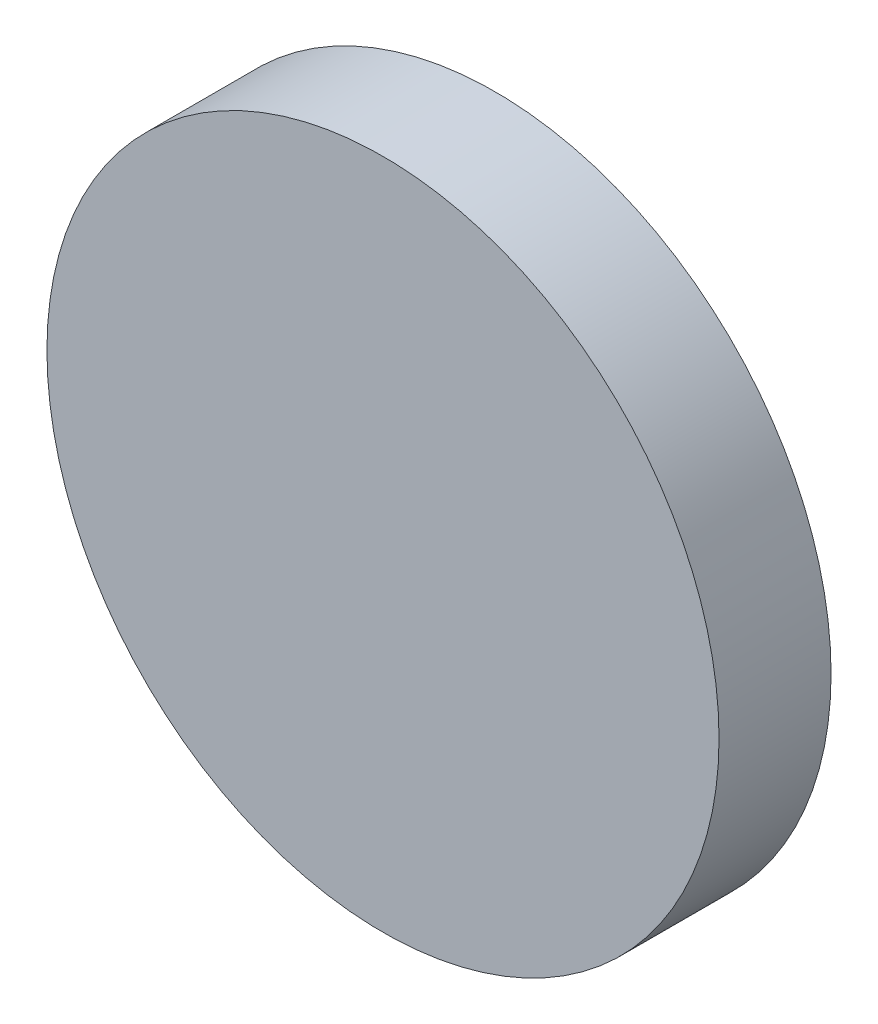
from build123d import *

# Parameters (mm, degrees)
ESQUISSE1_R      = 9
EXTRUSION1_DEPTH = 3


with BuildPart() as part:
    # Esquisse1 → Extrusion1 (new body)
    with BuildSketch(Plane.XY):
        Circle(ESQUISSE1_R)
    extrude(amount=EXTRUSION1_DEPTH)


solid = part.part
